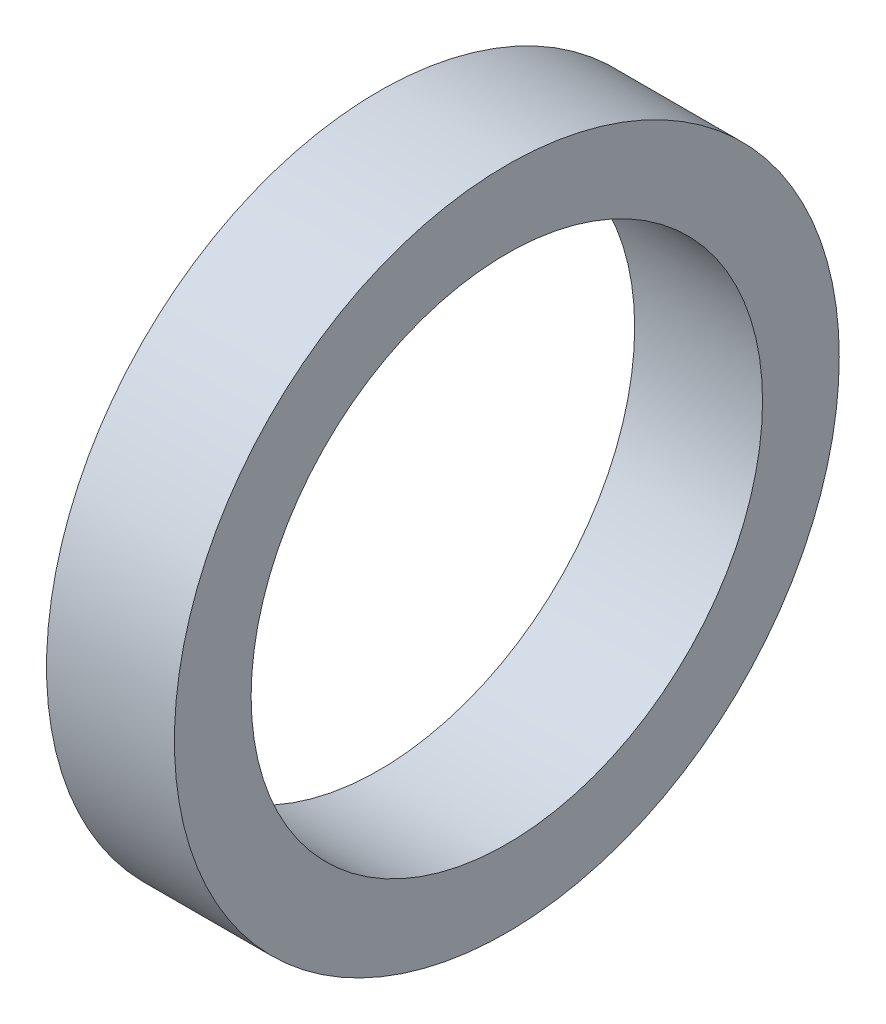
ISO-10303-21;
HEADER;
FILE_DESCRIPTION(('STEP AP214'),'2;1');
FILE_NAME('part.step','',(''),(''),'','','');
FILE_SCHEMA(('AUTOMOTIVE_DESIGN { 1 0 10303 214 1 1 1 1 }'));
ENDSEC;
DATA;
#1=APPLICATION_CONTEXT('core data for automotive mechanical design processes');
#2=APPLICATION_PROTOCOL_DEFINITION('international standard','automotive_design',2000,#1);
#3=PRODUCT_CONTEXT('',#1,'mechanical');
#4=PRODUCT('Part','Part','',(#3));
#5=PRODUCT_RELATED_PRODUCT_CATEGORY('part','',(#4));
#6=PRODUCT_DEFINITION_FORMATION('','',#4);
#7=PRODUCT_DEFINITION_CONTEXT('part definition',#1,'design');
#8=PRODUCT_DEFINITION('design','',#6,#7);
#9=PRODUCT_DEFINITION_SHAPE('','',#8);
#10=(LENGTH_UNIT() NAMED_UNIT(*) SI_UNIT(.MILLI.,.METRE.));
#11=(NAMED_UNIT(*) PLANE_ANGLE_UNIT() SI_UNIT($,.RADIAN.));
#12=(NAMED_UNIT(*) SI_UNIT($,.STERADIAN.) SOLID_ANGLE_UNIT());
#13=UNCERTAINTY_MEASURE_WITH_UNIT(LENGTH_MEASURE(1.E-05),#10,'distance_accuracy_value','');
#14=(GEOMETRIC_REPRESENTATION_CONTEXT(3) GLOBAL_UNCERTAINTY_ASSIGNED_CONTEXT((#13)) GLOBAL_UNIT_ASSIGNED_CONTEXT((#10,
#11,#12)) REPRESENTATION_CONTEXT('',''));
#15=CARTESIAN_POINT('',(0.,0.,0.));
#16=DIRECTION('',(0.,0.,1.));
#17=DIRECTION('',(1.,0.,0.));
#18=AXIS2_PLACEMENT_3D('',#15,#16,#17);
#19=CARTESIAN_POINT('',(-5.,0.,0.));
#20=DIRECTION('',(1.,0.,0.));
#21=DIRECTION('',(0.,0.,-1.));
#22=AXIS2_PLACEMENT_3D('',#19,#20,#21);
#23=CYLINDRICAL_SURFACE('',#22,13.);
#24=CARTESIAN_POINT('',(-5.,0.,0.));
#25=DIRECTION('',(1.,0.,0.));
#26=DIRECTION('',(0.,0.,-1.));
#27=AXIS2_PLACEMENT_3D('',#24,#25,#26);
#28=CIRCLE('',#27,13.);
#29=CARTESIAN_POINT('',(-5.,0.,-13.));
#30=VERTEX_POINT('',#29);
#31=EDGE_CURVE('E10',#30,#30,#28,.T.);
#32=ORIENTED_EDGE('',*,*,#31,.T.);
#33=EDGE_LOOP('',(#32));
#34=FACE_BOUND('',#33,.T.);
#35=CARTESIAN_POINT('',(0.,0.,0.));
#36=DIRECTION('',(1.,0.,0.));
#37=DIRECTION('',(0.,0.,-1.));
#38=AXIS2_PLACEMENT_3D('',#35,#36,#37);
#39=CIRCLE('',#38,13.);
#40=CARTESIAN_POINT('',(0.,0.,-13.));
#41=VERTEX_POINT('',#40);
#42=EDGE_CURVE('E37',#41,#41,#39,.T.);
#43=ORIENTED_EDGE('',*,*,#42,.F.);
#44=EDGE_LOOP('',(#43));
#45=FACE_BOUND('',#44,.T.);
#46=ADVANCED_FACE('F31',(#34,#45),#23,.T.);
#47=CARTESIAN_POINT('',(-5.,0.,0.));
#48=DIRECTION('',(1.,0.,0.));
#49=DIRECTION('',(0.,0.,-1.));
#50=AXIS2_PLACEMENT_3D('',#47,#48,#49);
#51=PLANE('',#50);
#52=CARTESIAN_POINT('',(-5.,0.,0.));
#53=DIRECTION('',(1.,0.,0.));
#54=DIRECTION('',(0.,0.,-1.));
#55=AXIS2_PLACEMENT_3D('',#52,#53,#54);
#56=CIRCLE('',#55,10.);
#57=CARTESIAN_POINT('',(-5.,0.,-10.));
#58=VERTEX_POINT('',#57);
#59=EDGE_CURVE('E41',#58,#58,#56,.T.);
#60=ORIENTED_EDGE('',*,*,#59,.T.);
#61=EDGE_LOOP('',(#60));
#62=FACE_BOUND('',#61,.T.);
#63=ORIENTED_EDGE('',*,*,#31,.F.);
#64=EDGE_LOOP('',(#63));
#65=FACE_BOUND('',#64,.T.);
#66=ADVANCED_FACE('F55',(#62,#65),#51,.F.);
#67=CARTESIAN_POINT('',(0.,0.,0.));
#68=DIRECTION('',(1.,0.,0.));
#69=DIRECTION('',(0.,0.,-1.));
#70=AXIS2_PLACEMENT_3D('',#67,#68,#69);
#71=PLANE('',#70);
#72=CARTESIAN_POINT('',(0.,0.,0.));
#73=DIRECTION('',(1.,0.,0.));
#74=DIRECTION('',(0.,0.,-1.));
#75=AXIS2_PLACEMENT_3D('',#72,#73,#74);
#76=CIRCLE('',#75,10.);
#77=CARTESIAN_POINT('',(0.,0.,-10.));
#78=VERTEX_POINT('',#77);
#79=EDGE_CURVE('E45',#78,#78,#76,.T.);
#80=ORIENTED_EDGE('',*,*,#79,.F.);
#81=EDGE_LOOP('',(#80));
#82=FACE_BOUND('',#81,.T.);
#83=ORIENTED_EDGE('',*,*,#42,.T.);
#84=EDGE_LOOP('',(#83));
#85=FACE_BOUND('',#84,.T.);
#86=ADVANCED_FACE('F53',(#82,#85),#71,.T.);
#87=CARTESIAN_POINT('',(-5.,0.,0.));
#88=DIRECTION('',(1.,0.,0.));
#89=DIRECTION('',(0.,0.,-1.));
#90=AXIS2_PLACEMENT_3D('',#87,#88,#89);
#91=CYLINDRICAL_SURFACE('',#90,10.);
#92=ORIENTED_EDGE('',*,*,#59,.F.);
#93=EDGE_LOOP('',(#92));
#94=FACE_BOUND('',#93,.T.);
#95=ORIENTED_EDGE('',*,*,#79,.T.);
#96=EDGE_LOOP('',(#95));
#97=FACE_BOUND('',#96,.T.);
#98=ADVANCED_FACE('F51',(#94,#97),#91,.F.);
#99=CLOSED_SHELL('',(#46,#66,#86,#98));
#100=MANIFOLD_SOLID_BREP('B2',#99);
#101=ADVANCED_BREP_SHAPE_REPRESENTATION('',(#18,#100),#14);
#102=SHAPE_DEFINITION_REPRESENTATION(#9,#101);
ENDSEC;
END-ISO-10303-21;
